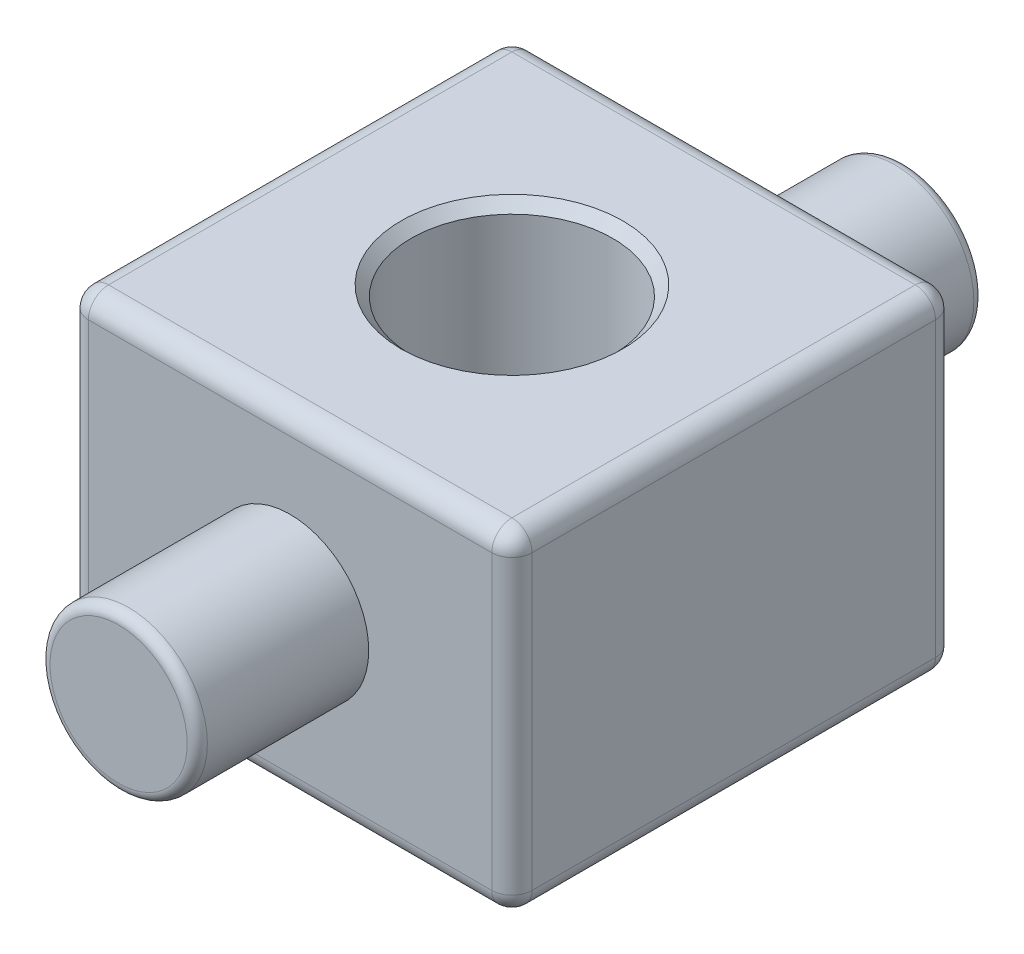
from build123d import *

# Parameters (mm, degrees)
BOSS_EXTRU_1_DEPTH      = 11
BOSS_EXTRU_1_DEPTH_BACK = 11
ESQUISSE1_W             = 22
ESQUISSE1_H             = 16.5
ESQUISSE2_R             = 3.9
BOSS_EXTRU_2_DEPTH      = 8.5
CONG_1_R                = 0.5
CONG_1_OF_SYM_TRIE1_R   = 0.5
ESQUISSE3_R             = 5
ENL_V_MAT_EXTRU_1_DEPTH = 12
ENL_V_MAT_EXTRU_2_REACH = 29.812
ESQUISSE4_R             = 3.5
CONG_2_R                = 1
CHANFREIN1_SIZE         = 0.5


with BuildPart() as part:
    # Esquisse1 → Boss.-Extru.1 (new, two sides: drawn at the far end of the back side and taken through both)
    with BuildSketch(Plane.XY.offset(-BOSS_EXTRU_1_DEPTH_BACK)):
        Rectangle(ESQUISSE1_W, ESQUISSE1_H)
    extrude(amount=BOSS_EXTRU_1_DEPTH + BOSS_EXTRU_1_DEPTH_BACK)

    # Esquisse2 → Boss.-Extru.2 (add)
    with BuildSketch(Plane.XY.offset(11)):
        Circle(ESQUISSE2_R)
    boss_extru_2 = extrude(amount=BOSS_EXTRU_2_DEPTH)

    # Cong_1
    cong_1_edges = [part.edges().sort_by_distance(p)[0] for p in [
        (-3.9, 0, 19.5),
    ]]
    fillet(cong_1_edges, radius=CONG_1_R)

    # Sym_trie1: Boss.-Extru.2 across plane
    add(boss_extru_2.mirror(Plane.XY))

    # Cong_1 of Sym_trie1
    cong_1_of_sym_trie1_edges = [part.edges().sort_by_distance(p)[0] for p in [
        (-3.9, 0, -19.5),
    ]]
    fillet(cong_1_of_sym_trie1_edges, radius=CONG_1_OF_SYM_TRIE1_R)

    # Esquisse3 → Enl_v. mat.-Extru.1 (cut)
    with BuildSketch(Plane(origin=(0, 8.25, 0), x_dir=(1, 0, 0), z_dir=(0, 1, 0))):
        with Locations(Location((0, 0, 0), (0, 0, 270))):
            Circle(ESQUISSE3_R)
    extrude(amount=-ENL_V_MAT_EXTRU_1_DEPTH, mode=Mode.SUBTRACT)

    # Esquisse4 → Enl_v. mat.-Extru.2 (cut, up to next)
    with BuildSketch(Plane.XZ.offset(8.25), mode=Mode.PRIVATE) as enl_v_mat_extru_2_sk1:
        with Locations(Location((0, 0, 0), (0, 0, 270))):
            Circle(ESQUISSE4_R)
    enl_v_mat_extru_2_tool1 = extrude(enl_v_mat_extru_2_sk1.sketch, amount=-ENL_V_MAT_EXTRU_2_REACH, mode=Mode.PRIVATE) & part.part
    add(enl_v_mat_extru_2_tool1.solids().sort_by_distance((0, -8.25, 0))[0], mode=Mode.SUBTRACT)

    # Cong_2
    cong_2_edges = [part.edges().sort_by_distance(p)[0] for p in [
        (-11, 0, -11),
        (11, 0, 11),
        (0, 8.25, 11),
        (0, -8.25, -11),
        (-11, 0, 11),
        (0, -8.25, 11),
        (11, 0, -11),
        (0, 8.25, -11),
        (11, -8.25, 0),
        (-11, -8.25, 0),
        (-11, 8.25, 0),
        (11, 8.25, 0),
    ]]
    fillet(cong_2_edges, radius=CONG_2_R)

    # Chanfrein1
    chanfrein1_edges = [part.edges().sort_by_distance(p)[0] for p in [
        (0, 8.25, -5),
        (0, -8.25, 3.5),
    ]]
    chamfer(chanfrein1_edges, length=CHANFREIN1_SIZE)


solid = part.part
